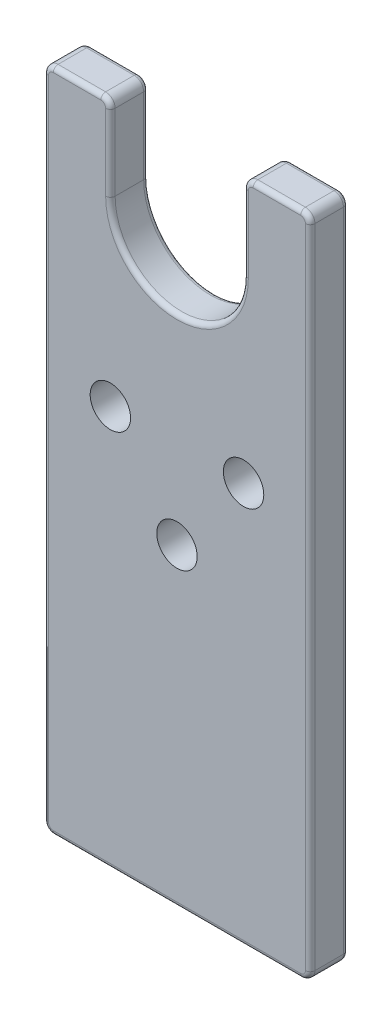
ISO-10303-21;
HEADER;
FILE_DESCRIPTION(('STEP AP214'),'2;1');
FILE_NAME('part.step','',(''),(''),'','','');
FILE_SCHEMA(('AUTOMOTIVE_DESIGN { 1 0 10303 214 1 1 1 1 }'));
ENDSEC;
DATA;
#1=APPLICATION_CONTEXT('core data for automotive mechanical design processes');
#2=APPLICATION_PROTOCOL_DEFINITION('international standard','automotive_design',2000,#1);
#3=PRODUCT_CONTEXT('',#1,'mechanical');
#4=PRODUCT('Part','Part','',(#3));
#5=PRODUCT_RELATED_PRODUCT_CATEGORY('part','',(#4));
#6=PRODUCT_DEFINITION_FORMATION('','',#4);
#7=PRODUCT_DEFINITION_CONTEXT('part definition',#1,'design');
#8=PRODUCT_DEFINITION('design','',#6,#7);
#9=PRODUCT_DEFINITION_SHAPE('','',#8);
#10=(LENGTH_UNIT() NAMED_UNIT(*) SI_UNIT(.MILLI.,.METRE.));
#11=(NAMED_UNIT(*) PLANE_ANGLE_UNIT() SI_UNIT($,.RADIAN.));
#12=(NAMED_UNIT(*) SI_UNIT($,.STERADIAN.) SOLID_ANGLE_UNIT());
#13=UNCERTAINTY_MEASURE_WITH_UNIT(LENGTH_MEASURE(1.E-05),#10,'distance_accuracy_value','');
#14=(GEOMETRIC_REPRESENTATION_CONTEXT(3) GLOBAL_UNCERTAINTY_ASSIGNED_CONTEXT((#13)) GLOBAL_UNIT_ASSIGNED_CONTEXT((#10,
#11,#12)) REPRESENTATION_CONTEXT('',''));
#15=CARTESIAN_POINT('',(0.,0.,0.));
#16=DIRECTION('',(0.,0.,1.));
#17=DIRECTION('',(1.,0.,0.));
#18=AXIS2_PLACEMENT_3D('',#15,#16,#17);
#19=CARTESIAN_POINT('',(44.45,193.675,12.7));
#20=DIRECTION('',(0.,0.,1.));
#21=DIRECTION('',(1.,0.,0.));
#22=AXIS2_PLACEMENT_3D('',#19,#20,#21);
#23=PLANE('',#22);
#24=DIRECTION('',(0.,-1.,0.));
#25=VECTOR('',#24,1.);
#26=CARTESIAN_POINT('',(87.3125,193.675,12.7));
#27=LINE('',#26,#25);
#28=CARTESIAN_POINT('',(87.3125,3.17500000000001,12.7));
#29=VERTEX_POINT('',#28);
#30=CARTESIAN_POINT('',(87.3125,219.075,12.7));
#31=VERTEX_POINT('',#30);
#32=EDGE_CURVE('E458',#29,#31,#27,.F.);
#33=ORIENTED_EDGE('',*,*,#32,.T.);
#34=CARTESIAN_POINT('',(85.725,219.075,12.7));
#35=DIRECTION('',(0.,0.,1.));
#36=DIRECTION('',(1.,0.,0.));
#37=AXIS2_PLACEMENT_3D('',#34,#35,#36);
#38=CIRCLE('',#37,1.5875);
#39=CARTESIAN_POINT('',(85.725,220.6625,12.7));
#40=VERTEX_POINT('',#39);
#41=EDGE_CURVE('E453',#31,#40,#38,.T.);
#42=ORIENTED_EDGE('',*,*,#41,.T.);
#43=DIRECTION('',(-1.,0.,0.));
#44=VECTOR('',#43,1.);
#45=CARTESIAN_POINT('',(69.85,220.6625,12.7));
#46=LINE('',#45,#44);
#47=CARTESIAN_POINT('',(69.85,220.6625,12.7));
#48=VERTEX_POINT('',#47);
#49=EDGE_CURVE('E456',#40,#48,#46,.T.);
#50=ORIENTED_EDGE('',*,*,#49,.T.);
#51=CARTESIAN_POINT('',(69.85,219.075,12.7));
#52=DIRECTION('',(0.,0.,1.));
#53=DIRECTION('',(1.,0.,0.));
#54=AXIS2_PLACEMENT_3D('',#51,#52,#53);
#55=CIRCLE('',#54,1.5875);
#56=CARTESIAN_POINT('',(68.2625,219.075,12.7));
#57=VERTEX_POINT('',#56);
#58=EDGE_CURVE('E460',#48,#57,#55,.T.);
#59=ORIENTED_EDGE('',*,*,#58,.T.);
#60=DIRECTION('',(0.,-1.,0.));
#61=VECTOR('',#60,1.);
#62=CARTESIAN_POINT('',(68.2625,193.675,12.7));
#63=LINE('',#62,#61);
#64=CARTESIAN_POINT('',(68.2625,193.675,12.7));
#65=VERTEX_POINT('',#64);
#66=EDGE_CURVE('E464',#57,#65,#63,.T.);
#67=ORIENTED_EDGE('',*,*,#66,.T.);
#68=CARTESIAN_POINT('',(44.45,193.675,12.7));
#69=DIRECTION('',(0.,0.,1.));
#70=DIRECTION('',(1.,0.,0.));
#71=AXIS2_PLACEMENT_3D('',#68,#69,#70);
#72=CIRCLE('',#71,23.8125);
#73=CARTESIAN_POINT('',(20.6375,193.675,12.7));
#74=VERTEX_POINT('',#73);
#75=EDGE_CURVE('E468',#65,#74,#72,.F.);
#76=ORIENTED_EDGE('',*,*,#75,.T.);
#77=DIRECTION('',(0.,-1.,0.));
#78=VECTOR('',#77,1.);
#79=CARTESIAN_POINT('',(20.6375,193.675,12.7));
#80=LINE('',#79,#78);
#81=CARTESIAN_POINT('',(20.6375,219.075,12.7));
#82=VERTEX_POINT('',#81);
#83=EDGE_CURVE('E226',#74,#82,#80,.F.);
#84=ORIENTED_EDGE('',*,*,#83,.T.);
#85=CARTESIAN_POINT('',(19.05,219.075,12.7));
#86=DIRECTION('',(0.,0.,1.));
#87=DIRECTION('',(1.,0.,0.));
#88=AXIS2_PLACEMENT_3D('',#85,#86,#87);
#89=CIRCLE('',#88,1.5875);
#90=CARTESIAN_POINT('',(19.05,220.6625,12.7));
#91=VERTEX_POINT('',#90);
#92=EDGE_CURVE('E220',#82,#91,#89,.T.);
#93=ORIENTED_EDGE('',*,*,#92,.T.);
#94=DIRECTION('',(-1.,0.,0.));
#95=VECTOR('',#94,1.);
#96=CARTESIAN_POINT('',(3.175,220.6625,12.7));
#97=LINE('',#96,#95);
#98=CARTESIAN_POINT('',(3.175,220.6625,12.7));
#99=VERTEX_POINT('',#98);
#100=EDGE_CURVE('E223',#91,#99,#97,.T.);
#101=ORIENTED_EDGE('',*,*,#100,.T.);
#102=CARTESIAN_POINT('',(3.175,219.075,12.7));
#103=DIRECTION('',(0.,0.,1.));
#104=DIRECTION('',(1.,0.,0.));
#105=AXIS2_PLACEMENT_3D('',#102,#103,#104);
#106=CIRCLE('',#105,1.5875);
#107=CARTESIAN_POINT('',(1.5875,219.075,12.7));
#108=VERTEX_POINT('',#107);
#109=EDGE_CURVE('E232',#99,#108,#106,.T.);
#110=ORIENTED_EDGE('',*,*,#109,.T.);
#111=DIRECTION('',(0.,1.,0.));
#112=VECTOR('',#111,1.);
#113=CARTESIAN_POINT('',(1.5875,193.675,12.7));
#114=LINE('',#113,#112);
#115=CARTESIAN_POINT('',(1.5875,3.175,12.7));
#116=VERTEX_POINT('',#115);
#117=EDGE_CURVE('E231',#108,#116,#114,.F.);
#118=ORIENTED_EDGE('',*,*,#117,.T.);
#119=CARTESIAN_POINT('',(3.175,3.175,12.7));
#120=DIRECTION('',(0.,0.,1.));
#121=DIRECTION('',(1.,0.,0.));
#122=AXIS2_PLACEMENT_3D('',#119,#120,#121);
#123=CIRCLE('',#122,1.5875);
#124=CARTESIAN_POINT('',(3.175,1.5875,12.7));
#125=VERTEX_POINT('',#124);
#126=EDGE_CURVE('E470',#116,#125,#123,.T.);
#127=ORIENTED_EDGE('',*,*,#126,.T.);
#128=DIRECTION('',(1.,0.,0.));
#129=VECTOR('',#128,1.);
#130=CARTESIAN_POINT('',(85.725,1.58749999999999,12.7));
#131=LINE('',#130,#129);
#132=CARTESIAN_POINT('',(85.725,1.58749999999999,12.7));
#133=VERTEX_POINT('',#132);
#134=EDGE_CURVE('E466',#125,#133,#131,.T.);
#135=ORIENTED_EDGE('',*,*,#134,.T.);
#136=CARTESIAN_POINT('',(85.725,3.17500000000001,12.7));
#137=DIRECTION('',(0.,0.,1.));
#138=DIRECTION('',(1.,0.,0.));
#139=AXIS2_PLACEMENT_3D('',#136,#137,#138);
#140=CIRCLE('',#139,1.5875);
#141=EDGE_CURVE('E462',#133,#29,#140,.T.);
#142=ORIENTED_EDGE('',*,*,#141,.T.);
#143=EDGE_LOOP('',(#33,#42,#50,#59,#67,#76,#84,#93,#101,#110,#118,#127,#135,#142));
#144=FACE_BOUND('',#143,.T.);
#145=CARTESIAN_POINT('',(44.4500000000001,104.775,12.7));
#146=DIRECTION('',(0.,0.,1.));
#147=DIRECTION('',(1.,0.,0.));
#148=AXIS2_PLACEMENT_3D('',#145,#146,#147);
#149=CIRCLE('',#148,6.7437);
#150=CARTESIAN_POINT('',(51.1937000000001,104.775,12.7));
#151=VERTEX_POINT('',#150);
#152=EDGE_CURVE('E508',#151,#151,#149,.T.);
#153=ORIENTED_EDGE('',*,*,#152,.F.);
#154=EDGE_LOOP('',(#153));
#155=FACE_BOUND('',#154,.T.);
#156=CARTESIAN_POINT('',(22.2250000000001,133.739183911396,12.7));
#157=DIRECTION('',(0.,0.,1.));
#158=DIRECTION('',(1.,0.,0.));
#159=AXIS2_PLACEMENT_3D('',#156,#157,#158);
#160=CIRCLE('',#159,6.7437);
#161=CARTESIAN_POINT('',(28.9687000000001,133.739183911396,12.7));
#162=VERTEX_POINT('',#161);
#163=EDGE_CURVE('E502',#162,#162,#160,.T.);
#164=ORIENTED_EDGE('',*,*,#163,.F.);
#165=EDGE_LOOP('',(#164));
#166=FACE_BOUND('',#165,.T.);
#167=CARTESIAN_POINT('',(66.6750000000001,133.739183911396,12.7));
#168=DIRECTION('',(0.,0.,1.));
#169=DIRECTION('',(1.,0.,0.));
#170=AXIS2_PLACEMENT_3D('',#167,#168,#169);
#171=CIRCLE('',#170,6.74370000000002);
#172=CARTESIAN_POINT('',(73.4187000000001,133.739183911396,12.7));
#173=VERTEX_POINT('',#172);
#174=EDGE_CURVE('E514',#173,#173,#171,.T.);
#175=ORIENTED_EDGE('',*,*,#174,.F.);
#176=EDGE_LOOP('',(#175));
#177=FACE_BOUND('',#176,.T.);
#178=ADVANCED_FACE('F34',(#144,#155,#166,#177),#23,.T.);
#179=CARTESIAN_POINT('',(44.45,193.675,0.));
#180=DIRECTION('',(0.,0.,1.));
#181=DIRECTION('',(1.,0.,0.));
#182=AXIS2_PLACEMENT_3D('',#179,#180,#181);
#183=PLANE('',#182);
#184=DIRECTION('',(-1.,0.,0.));
#185=VECTOR('',#184,1.);
#186=CARTESIAN_POINT('',(44.45,220.6625,0.));
#187=LINE('',#186,#185);
#188=CARTESIAN_POINT('',(69.85,220.6625,0.));
#189=VERTEX_POINT('',#188);
#190=CARTESIAN_POINT('',(85.725,220.6625,0.));
#191=VERTEX_POINT('',#190);
#192=EDGE_CURVE('E423',#189,#191,#187,.F.);
#193=ORIENTED_EDGE('',*,*,#192,.T.);
#194=CARTESIAN_POINT('',(85.725,219.075,0.));
#195=DIRECTION('',(0.,0.,1.));
#196=DIRECTION('',(1.,0.,0.));
#197=AXIS2_PLACEMENT_3D('',#194,#195,#196);
#198=CIRCLE('',#197,1.5875);
#199=CARTESIAN_POINT('',(87.3125,219.075,0.));
#200=VERTEX_POINT('',#199);
#201=EDGE_CURVE('E420',#191,#200,#198,.F.);
#202=ORIENTED_EDGE('',*,*,#201,.T.);
#203=DIRECTION('',(0.,-1.,0.));
#204=VECTOR('',#203,1.);
#205=CARTESIAN_POINT('',(87.3125,3.17500000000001,0.));
#206=LINE('',#205,#204);
#207=CARTESIAN_POINT('',(87.3125,3.17500000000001,0.));
#208=VERTEX_POINT('',#207);
#209=EDGE_CURVE('E425',#200,#208,#206,.T.);
#210=ORIENTED_EDGE('',*,*,#209,.T.);
#211=CARTESIAN_POINT('',(85.725,3.17500000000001,0.));
#212=DIRECTION('',(0.,0.,1.));
#213=DIRECTION('',(1.,0.,0.));
#214=AXIS2_PLACEMENT_3D('',#211,#212,#213);
#215=CIRCLE('',#214,1.5875);
#216=CARTESIAN_POINT('',(85.725,1.5875,0.));
#217=VERTEX_POINT('',#216);
#218=EDGE_CURVE('E429',#208,#217,#215,.F.);
#219=ORIENTED_EDGE('',*,*,#218,.T.);
#220=DIRECTION('',(1.,0.,0.));
#221=VECTOR('',#220,1.);
#222=CARTESIAN_POINT('',(44.45,1.58749999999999,0.));
#223=LINE('',#222,#221);
#224=CARTESIAN_POINT('',(3.175,1.5875,0.));
#225=VERTEX_POINT('',#224);
#226=EDGE_CURVE('E433',#217,#225,#223,.F.);
#227=ORIENTED_EDGE('',*,*,#226,.T.);
#228=CARTESIAN_POINT('',(3.175,3.175,0.));
#229=DIRECTION('',(0.,0.,1.));
#230=DIRECTION('',(1.,0.,0.));
#231=AXIS2_PLACEMENT_3D('',#228,#229,#230);
#232=CIRCLE('',#231,1.5875);
#233=CARTESIAN_POINT('',(1.5875,3.175,0.));
#234=VERTEX_POINT('',#233);
#235=EDGE_CURVE('E437',#225,#234,#232,.F.);
#236=ORIENTED_EDGE('',*,*,#235,.T.);
#237=DIRECTION('',(0.,1.,0.));
#238=VECTOR('',#237,1.);
#239=CARTESIAN_POINT('',(1.5875,219.075,0.));
#240=LINE('',#239,#238);
#241=CARTESIAN_POINT('',(1.5875,219.075,0.));
#242=VERTEX_POINT('',#241);
#243=EDGE_CURVE('E380',#234,#242,#240,.T.);
#244=ORIENTED_EDGE('',*,*,#243,.T.);
#245=CARTESIAN_POINT('',(3.175,219.075,0.));
#246=DIRECTION('',(0.,0.,1.));
#247=DIRECTION('',(1.,0.,0.));
#248=AXIS2_PLACEMENT_3D('',#245,#246,#247);
#249=CIRCLE('',#248,1.5875);
#250=CARTESIAN_POINT('',(3.175,220.6625,0.));
#251=VERTEX_POINT('',#250);
#252=EDGE_CURVE('E374',#242,#251,#249,.F.);
#253=ORIENTED_EDGE('',*,*,#252,.T.);
#254=DIRECTION('',(-1.,0.,0.));
#255=VECTOR('',#254,1.);
#256=CARTESIAN_POINT('',(44.45,220.6625,0.));
#257=LINE('',#256,#255);
#258=CARTESIAN_POINT('',(19.05,220.6625,0.));
#259=VERTEX_POINT('',#258);
#260=EDGE_CURVE('E445',#251,#259,#257,.F.);
#261=ORIENTED_EDGE('',*,*,#260,.T.);
#262=CARTESIAN_POINT('',(19.05,219.075,0.));
#263=DIRECTION('',(0.,0.,1.));
#264=DIRECTION('',(1.,0.,0.));
#265=AXIS2_PLACEMENT_3D('',#262,#263,#264);
#266=CIRCLE('',#265,1.5875);
#267=CARTESIAN_POINT('',(20.6375,219.075,0.));
#268=VERTEX_POINT('',#267);
#269=EDGE_CURVE('E442',#259,#268,#266,.F.);
#270=ORIENTED_EDGE('',*,*,#269,.T.);
#271=DIRECTION('',(0.,-1.,0.));
#272=VECTOR('',#271,1.);
#273=CARTESIAN_POINT('',(20.6375,193.675,0.));
#274=LINE('',#273,#272);
#275=CARTESIAN_POINT('',(20.6375,193.675,0.));
#276=VERTEX_POINT('',#275);
#277=EDGE_CURVE('E439',#268,#276,#274,.T.);
#278=ORIENTED_EDGE('',*,*,#277,.T.);
#279=CARTESIAN_POINT('',(44.45,193.675,0.));
#280=DIRECTION('',(0.,0.,1.));
#281=DIRECTION('',(1.,0.,0.));
#282=AXIS2_PLACEMENT_3D('',#279,#280,#281);
#283=CIRCLE('',#282,23.8125);
#284=CARTESIAN_POINT('',(68.2625,193.675,0.));
#285=VERTEX_POINT('',#284);
#286=EDGE_CURVE('E435',#276,#285,#283,.T.);
#287=ORIENTED_EDGE('',*,*,#286,.T.);
#288=DIRECTION('',(0.,-1.,0.));
#289=VECTOR('',#288,1.);
#290=CARTESIAN_POINT('',(68.2625,193.675,0.));
#291=LINE('',#290,#289);
#292=CARTESIAN_POINT('',(68.2625,219.075,0.));
#293=VERTEX_POINT('',#292);
#294=EDGE_CURVE('E431',#285,#293,#291,.F.);
#295=ORIENTED_EDGE('',*,*,#294,.T.);
#296=CARTESIAN_POINT('',(69.85,219.075,0.));
#297=DIRECTION('',(0.,0.,1.));
#298=DIRECTION('',(1.,0.,0.));
#299=AXIS2_PLACEMENT_3D('',#296,#297,#298);
#300=CIRCLE('',#299,1.5875);
#301=EDGE_CURVE('E427',#293,#189,#300,.F.);
#302=ORIENTED_EDGE('',*,*,#301,.T.);
#303=EDGE_LOOP('',(#193,#202,#210,#219,#227,#236,#244,#253,#261,#270,#278,#287,#295,#302));
#304=FACE_BOUND('',#303,.T.);
#305=CARTESIAN_POINT('',(44.4500000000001,104.775,0.));
#306=DIRECTION('',(0.,0.,1.));
#307=DIRECTION('',(1.,0.,0.));
#308=AXIS2_PLACEMENT_3D('',#305,#306,#307);
#309=CIRCLE('',#308,6.7437);
#310=CARTESIAN_POINT('',(51.1937000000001,104.775,0.));
#311=VERTEX_POINT('',#310);
#312=EDGE_CURVE('E511',#311,#311,#309,.T.);
#313=ORIENTED_EDGE('',*,*,#312,.T.);
#314=EDGE_LOOP('',(#313));
#315=FACE_BOUND('',#314,.T.);
#316=CARTESIAN_POINT('',(22.2250000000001,133.739183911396,0.));
#317=DIRECTION('',(0.,0.,1.));
#318=DIRECTION('',(1.,0.,0.));
#319=AXIS2_PLACEMENT_3D('',#316,#317,#318);
#320=CIRCLE('',#319,6.7437);
#321=CARTESIAN_POINT('',(28.9687000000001,133.739183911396,0.));
#322=VERTEX_POINT('',#321);
#323=EDGE_CURVE('E505',#322,#322,#320,.T.);
#324=ORIENTED_EDGE('',*,*,#323,.T.);
#325=EDGE_LOOP('',(#324));
#326=FACE_BOUND('',#325,.T.);
#327=CARTESIAN_POINT('',(66.6750000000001,133.739183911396,0.));
#328=DIRECTION('',(0.,0.,1.));
#329=DIRECTION('',(1.,0.,0.));
#330=AXIS2_PLACEMENT_3D('',#327,#328,#329);
#331=CIRCLE('',#330,6.74370000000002);
#332=CARTESIAN_POINT('',(73.4187000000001,133.739183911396,0.));
#333=VERTEX_POINT('',#332);
#334=EDGE_CURVE('E249',#333,#333,#331,.T.);
#335=ORIENTED_EDGE('',*,*,#334,.T.);
#336=EDGE_LOOP('',(#335));
#337=FACE_BOUND('',#336,.T.);
#338=ADVANCED_FACE('F526',(#304,#315,#326,#337),#183,.F.);
#339=CARTESIAN_POINT('',(0.,0.,12.7));
#340=DIRECTION('',(-1.,0.,0.));
#341=DIRECTION('',(0.,-1.,0.));
#342=AXIS2_PLACEMENT_3D('',#339,#340,#341);
#343=PLANE('',#342);
#344=DIRECTION('',(0.,0.,-1.));
#345=VECTOR('',#344,1.);
#346=CARTESIAN_POINT('',(0.,3.175,12.7));
#347=LINE('',#346,#345);
#348=CARTESIAN_POINT('',(0.,3.175,1.5875));
#349=VERTEX_POINT('',#348);
#350=CARTESIAN_POINT('',(0.,3.175,11.1125));
#351=VERTEX_POINT('',#350);
#352=EDGE_CURVE('E371',#349,#351,#347,.F.);
#353=ORIENTED_EDGE('',*,*,#352,.T.);
#354=DIRECTION('',(0.,1.,0.));
#355=VECTOR('',#354,1.);
#356=CARTESIAN_POINT('',(0.,0.,11.1125));
#357=LINE('',#356,#355);
#358=CARTESIAN_POINT('',(0.,219.075,11.1125));
#359=VERTEX_POINT('',#358);
#360=EDGE_CURVE('E347',#351,#359,#357,.T.);
#361=ORIENTED_EDGE('',*,*,#360,.T.);
#362=DIRECTION('',(0.,0.,-1.));
#363=VECTOR('',#362,1.);
#364=CARTESIAN_POINT('',(0.,219.075,0.));
#365=LINE('',#364,#363);
#366=CARTESIAN_POINT('',(0.,219.075,1.5875));
#367=VERTEX_POINT('',#366);
#368=EDGE_CURVE('E361',#359,#367,#365,.T.);
#369=ORIENTED_EDGE('',*,*,#368,.T.);
#370=DIRECTION('',(0.,1.,0.));
#371=VECTOR('',#370,1.);
#372=CARTESIAN_POINT('',(0.,3.17500000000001,1.5875));
#373=LINE('',#372,#371);
#374=EDGE_CURVE('E344',#367,#349,#373,.F.);
#375=ORIENTED_EDGE('',*,*,#374,.T.);
#376=EDGE_LOOP('',(#353,#361,#369,#375));
#377=FACE_BOUND('',#376,.T.);
#378=ADVANCED_FACE('F366',(#377),#343,.T.);
#379=CARTESIAN_POINT('',(0.,0.,12.7));
#380=DIRECTION('',(0.,1.,0.));
#381=DIRECTION('',(0.,0.,1.));
#382=AXIS2_PLACEMENT_3D('',#379,#380,#381);
#383=PLANE('',#382);
#384=DIRECTION('',(0.,0.,-1.));
#385=VECTOR('',#384,1.);
#386=CARTESIAN_POINT('',(85.725,0.,12.7));
#387=LINE('',#386,#385);
#388=CARTESIAN_POINT('',(85.725,0.,1.5875));
#389=VERTEX_POINT('',#388);
#390=CARTESIAN_POINT('',(85.725,0.,11.1125));
#391=VERTEX_POINT('',#390);
#392=EDGE_CURVE('E243',#389,#391,#387,.F.);
#393=ORIENTED_EDGE('',*,*,#392,.T.);
#394=DIRECTION('',(1.,0.,0.));
#395=VECTOR('',#394,1.);
#396=CARTESIAN_POINT('',(3.175,0.,11.1125));
#397=LINE('',#396,#395);
#398=CARTESIAN_POINT('',(3.175,0.,11.1125));
#399=VERTEX_POINT('',#398);
#400=EDGE_CURVE('E396',#391,#399,#397,.F.);
#401=ORIENTED_EDGE('',*,*,#400,.T.);
#402=DIRECTION('',(0.,0.,-1.));
#403=VECTOR('',#402,1.);
#404=CARTESIAN_POINT('',(3.175,0.,0.));
#405=LINE('',#404,#403);
#406=CARTESIAN_POINT('',(3.175,0.,1.5875));
#407=VERTEX_POINT('',#406);
#408=EDGE_CURVE('E477',#399,#407,#405,.T.);
#409=ORIENTED_EDGE('',*,*,#408,.T.);
#410=DIRECTION('',(1.,0.,0.));
#411=VECTOR('',#410,1.);
#412=CARTESIAN_POINT('',(0.,0.,1.5875));
#413=LINE('',#412,#411);
#414=EDGE_CURVE('E398',#407,#389,#413,.T.);
#415=ORIENTED_EDGE('',*,*,#414,.T.);
#416=EDGE_LOOP('',(#393,#401,#409,#415));
#417=FACE_BOUND('',#416,.T.);
#418=ADVANCED_FACE('F537',(#417),#383,.F.);
#419=CARTESIAN_POINT('',(88.9,222.25,12.7));
#420=DIRECTION('',(1.,0.,0.));
#421=DIRECTION('',(0.,1.,0.));
#422=AXIS2_PLACEMENT_3D('',#419,#420,#421);
#423=PLANE('',#422);
#424=DIRECTION('',(0.,0.,-1.));
#425=VECTOR('',#424,1.);
#426=CARTESIAN_POINT('',(88.9,219.075,12.7));
#427=LINE('',#426,#425);
#428=CARTESIAN_POINT('',(88.9,219.075,1.5875));
#429=VERTEX_POINT('',#428);
#430=CARTESIAN_POINT('',(88.9,219.075,11.1125));
#431=VERTEX_POINT('',#430);
#432=EDGE_CURVE('E479',#429,#431,#427,.F.);
#433=ORIENTED_EDGE('',*,*,#432,.T.);
#434=DIRECTION('',(0.,-1.,0.));
#435=VECTOR('',#434,1.);
#436=CARTESIAN_POINT('',(88.9,222.25,11.1125));
#437=LINE('',#436,#435);
#438=CARTESIAN_POINT('',(88.9,3.17500000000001,11.1125));
#439=VERTEX_POINT('',#438);
#440=EDGE_CURVE('E412',#431,#439,#437,.T.);
#441=ORIENTED_EDGE('',*,*,#440,.T.);
#442=DIRECTION('',(0.,0.,-1.));
#443=VECTOR('',#442,1.);
#444=CARTESIAN_POINT('',(88.9,3.17500000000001,0.));
#445=LINE('',#444,#443);
#446=CARTESIAN_POINT('',(88.9,3.17500000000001,1.5875));
#447=VERTEX_POINT('',#446);
#448=EDGE_CURVE('E370',#439,#447,#445,.T.);
#449=ORIENTED_EDGE('',*,*,#448,.T.);
#450=DIRECTION('',(0.,-1.,0.));
#451=VECTOR('',#450,1.);
#452=CARTESIAN_POINT('',(88.9,219.075,1.5875));
#453=LINE('',#452,#451);
#454=EDGE_CURVE('E414',#447,#429,#453,.F.);
#455=ORIENTED_EDGE('',*,*,#454,.T.);
#456=EDGE_LOOP('',(#433,#441,#449,#455));
#457=FACE_BOUND('',#456,.T.);
#458=ADVANCED_FACE('F540',(#457),#423,.T.);
#459=CARTESIAN_POINT('',(88.9,222.25,12.7));
#460=DIRECTION('',(0.,-1.,0.));
#461=DIRECTION('',(0.,0.,-1.));
#462=AXIS2_PLACEMENT_3D('',#459,#460,#461);
#463=PLANE('',#462);
#464=DIRECTION('',(0.,0.,-1.));
#465=VECTOR('',#464,1.);
#466=CARTESIAN_POINT('',(69.85,222.25,12.7));
#467=LINE('',#466,#465);
#468=CARTESIAN_POINT('',(69.85,222.25,1.5875));
#469=VERTEX_POINT('',#468);
#470=CARTESIAN_POINT('',(69.85,222.25,11.1125));
#471=VERTEX_POINT('',#470);
#472=EDGE_CURVE('E485',#469,#471,#467,.F.);
#473=ORIENTED_EDGE('',*,*,#472,.T.);
#474=DIRECTION('',(-1.,0.,0.));
#475=VECTOR('',#474,1.);
#476=CARTESIAN_POINT('',(85.725,222.25,11.1125));
#477=LINE('',#476,#475);
#478=CARTESIAN_POINT('',(85.725,222.25,11.1125));
#479=VERTEX_POINT('',#478);
#480=EDGE_CURVE('E416',#471,#479,#477,.F.);
#481=ORIENTED_EDGE('',*,*,#480,.T.);
#482=DIRECTION('',(0.,0.,-1.));
#483=VECTOR('',#482,1.);
#484=CARTESIAN_POINT('',(85.725,222.25,0.));
#485=LINE('',#484,#483);
#486=CARTESIAN_POINT('',(85.725,222.25,1.5875));
#487=VERTEX_POINT('',#486);
#488=EDGE_CURVE('E488',#479,#487,#485,.T.);
#489=ORIENTED_EDGE('',*,*,#488,.T.);
#490=DIRECTION('',(-1.,0.,0.));
#491=VECTOR('',#490,1.);
#492=CARTESIAN_POINT('',(88.9,222.25,1.5875));
#493=LINE('',#492,#491);
#494=EDGE_CURVE('E418',#487,#469,#493,.T.);
#495=ORIENTED_EDGE('',*,*,#494,.T.);
#496=EDGE_LOOP('',(#473,#481,#489,#495));
#497=FACE_BOUND('',#496,.T.);
#498=ADVANCED_FACE('F544',(#497),#463,.F.);
#499=CARTESIAN_POINT('',(66.675,222.25,12.7));
#500=DIRECTION('',(1.,0.,0.));
#501=DIRECTION('',(0.,0.,-1.));
#502=AXIS2_PLACEMENT_3D('',#499,#500,#501);
#503=PLANE('',#502);
#504=DIRECTION('',(0.,0.,-1.));
#505=VECTOR('',#504,1.);
#506=CARTESIAN_POINT('',(66.675,193.675,12.7));
#507=LINE('',#506,#505);
#508=CARTESIAN_POINT('',(66.675,193.675,11.1125));
#509=VERTEX_POINT('',#508);
#510=CARTESIAN_POINT('',(66.675,193.675,1.5875));
#511=VERTEX_POINT('',#510);
#512=EDGE_CURVE('E499',#509,#511,#507,.T.);
#513=ORIENTED_EDGE('',*,*,#512,.F.);
#514=DIRECTION('',(0.,-1.,0.));
#515=VECTOR('',#514,1.);
#516=CARTESIAN_POINT('',(66.675,219.075,11.1125));
#517=LINE('',#516,#515);
#518=CARTESIAN_POINT('',(66.675,219.075,11.1125));
#519=VERTEX_POINT('',#518);
#520=EDGE_CURVE('E400',#509,#519,#517,.F.);
#521=ORIENTED_EDGE('',*,*,#520,.T.);
#522=DIRECTION('',(0.,0.,-1.));
#523=VECTOR('',#522,1.);
#524=CARTESIAN_POINT('',(66.675,219.075,12.7));
#525=LINE('',#524,#523);
#526=CARTESIAN_POINT('',(66.675,219.075,1.5875));
#527=VERTEX_POINT('',#526);
#528=EDGE_CURVE('E491',#519,#527,#525,.T.);
#529=ORIENTED_EDGE('',*,*,#528,.T.);
#530=DIRECTION('',(0.,-1.,0.));
#531=VECTOR('',#530,1.);
#532=CARTESIAN_POINT('',(66.675,222.25,1.5875));
#533=LINE('',#532,#531);
#534=EDGE_CURVE('E402',#527,#511,#533,.T.);
#535=ORIENTED_EDGE('',*,*,#534,.T.);
#536=EDGE_LOOP('',(#513,#521,#529,#535));
#537=FACE_BOUND('',#536,.T.);
#538=ADVANCED_FACE('F548',(#537),#503,.F.);
#539=CARTESIAN_POINT('',(44.45,193.675,12.7));
#540=DIRECTION('',(0.,0.,-1.));
#541=DIRECTION('',(-1.,0.,0.));
#542=AXIS2_PLACEMENT_3D('',#539,#540,#541);
#543=CYLINDRICAL_SURFACE('',#542,22.225);
#544=DIRECTION('',(0.,0.,-1.));
#545=VECTOR('',#544,1.);
#546=CARTESIAN_POINT('',(22.225,193.675,12.7));
#547=LINE('',#546,#545);
#548=CARTESIAN_POINT('',(22.225,193.675,11.1125));
#549=VERTEX_POINT('',#548);
#550=CARTESIAN_POINT('',(22.225,193.675,1.5875));
#551=VERTEX_POINT('',#550);
#552=EDGE_CURVE('E500',#549,#551,#547,.T.);
#553=ORIENTED_EDGE('',*,*,#552,.F.);
#554=CARTESIAN_POINT('',(44.45,193.675,11.1125));
#555=DIRECTION('',(0.,0.,1.));
#556=DIRECTION('',(1.,0.,0.));
#557=AXIS2_PLACEMENT_3D('',#554,#555,#556);
#558=CIRCLE('',#557,22.225);
#559=EDGE_CURVE('E390',#549,#509,#558,.T.);
#560=ORIENTED_EDGE('',*,*,#559,.T.);
#561=ORIENTED_EDGE('',*,*,#512,.T.);
#562=CARTESIAN_POINT('',(44.45,193.675,1.5875));
#563=DIRECTION('',(0.,0.,1.));
#564=DIRECTION('',(1.,0.,0.));
#565=AXIS2_PLACEMENT_3D('',#562,#563,#564);
#566=CIRCLE('',#565,22.225);
#567=EDGE_CURVE('E392',#511,#551,#566,.F.);
#568=ORIENTED_EDGE('',*,*,#567,.T.);
#569=EDGE_LOOP('',(#553,#560,#561,#568));
#570=FACE_BOUND('',#569,.T.);
#571=ADVANCED_FACE('F552',(#570),#543,.F.);
#572=CARTESIAN_POINT('',(22.225,222.25,12.7));
#573=DIRECTION('',(1.,0.,0.));
#574=DIRECTION('',(0.,1.,0.));
#575=AXIS2_PLACEMENT_3D('',#572,#573,#574);
#576=PLANE('',#575);
#577=DIRECTION('',(0.,0.,-1.));
#578=VECTOR('',#577,1.);
#579=CARTESIAN_POINT('',(22.225,219.075,12.7));
#580=LINE('',#579,#578);
#581=CARTESIAN_POINT('',(22.225,219.075,1.5875));
#582=VERTEX_POINT('',#581);
#583=CARTESIAN_POINT('',(22.225,219.075,11.1125));
#584=VERTEX_POINT('',#583);
#585=EDGE_CURVE('E494',#582,#584,#580,.F.);
#586=ORIENTED_EDGE('',*,*,#585,.T.);
#587=DIRECTION('',(0.,-1.,0.));
#588=VECTOR('',#587,1.);
#589=CARTESIAN_POINT('',(22.225,222.25,11.1125));
#590=LINE('',#589,#588);
#591=EDGE_CURVE('E338',#584,#549,#590,.T.);
#592=ORIENTED_EDGE('',*,*,#591,.T.);
#593=ORIENTED_EDGE('',*,*,#552,.T.);
#594=DIRECTION('',(0.,-1.,0.));
#595=VECTOR('',#594,1.);
#596=CARTESIAN_POINT('',(22.225,219.075,1.5875));
#597=LINE('',#596,#595);
#598=EDGE_CURVE('E345',#551,#582,#597,.F.);
#599=ORIENTED_EDGE('',*,*,#598,.T.);
#600=EDGE_LOOP('',(#586,#592,#593,#599));
#601=FACE_BOUND('',#600,.T.);
#602=ADVANCED_FACE('F556',(#601),#576,.T.);
#603=CARTESIAN_POINT('',(22.225,222.25,12.7));
#604=DIRECTION('',(0.,-1.,0.));
#605=DIRECTION('',(0.,0.,-1.));
#606=AXIS2_PLACEMENT_3D('',#603,#604,#605);
#607=PLANE('',#606);
#608=DIRECTION('',(0.,0.,-1.));
#609=VECTOR('',#608,1.);
#610=CARTESIAN_POINT('',(3.175,222.25,12.7));
#611=LINE('',#610,#609);
#612=CARTESIAN_POINT('',(3.175,222.25,1.5875));
#613=VERTEX_POINT('',#612);
#614=CARTESIAN_POINT('',(3.175,222.25,11.1125));
#615=VERTEX_POINT('',#614);
#616=EDGE_CURVE('E362',#613,#615,#611,.F.);
#617=ORIENTED_EDGE('',*,*,#616,.T.);
#618=DIRECTION('',(-1.,0.,0.));
#619=VECTOR('',#618,1.);
#620=CARTESIAN_POINT('',(19.05,222.25,11.1125));
#621=LINE('',#620,#619);
#622=CARTESIAN_POINT('',(19.05,222.25,11.1125));
#623=VERTEX_POINT('',#622);
#624=EDGE_CURVE('E11',#615,#623,#621,.F.);
#625=ORIENTED_EDGE('',*,*,#624,.T.);
#626=DIRECTION('',(0.,0.,-1.));
#627=VECTOR('',#626,1.);
#628=CARTESIAN_POINT('',(19.05,222.25,0.));
#629=LINE('',#628,#627);
#630=CARTESIAN_POINT('',(19.05,222.25,1.5875));
#631=VERTEX_POINT('',#630);
#632=EDGE_CURVE('E496',#623,#631,#629,.T.);
#633=ORIENTED_EDGE('',*,*,#632,.T.);
#634=DIRECTION('',(-1.,0.,0.));
#635=VECTOR('',#634,1.);
#636=CARTESIAN_POINT('',(22.225,222.25,1.5875));
#637=LINE('',#636,#635);
#638=EDGE_CURVE('E43',#631,#613,#637,.T.);
#639=ORIENTED_EDGE('',*,*,#638,.T.);
#640=EDGE_LOOP('',(#617,#625,#633,#639));
#641=FACE_BOUND('',#640,.T.);
#642=ADVANCED_FACE('F560',(#641),#607,.F.);
#643=CARTESIAN_POINT('',(22.2250000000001,133.739183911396,12.7));
#644=DIRECTION('',(0.,0.,-1.));
#645=DIRECTION('',(-1.,0.,0.));
#646=AXIS2_PLACEMENT_3D('',#643,#644,#645);
#647=CYLINDRICAL_SURFACE('',#646,6.7437);
#648=ORIENTED_EDGE('',*,*,#163,.T.);
#649=EDGE_LOOP('',(#648));
#650=FACE_BOUND('',#649,.T.);
#651=ORIENTED_EDGE('',*,*,#323,.F.);
#652=EDGE_LOOP('',(#651));
#653=FACE_BOUND('',#652,.T.);
#654=ADVANCED_FACE('F534',(#650,#653),#647,.F.);
#655=CARTESIAN_POINT('',(44.4500000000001,104.775,12.7));
#656=DIRECTION('',(0.,0.,-1.));
#657=DIRECTION('',(-1.,0.,0.));
#658=AXIS2_PLACEMENT_3D('',#655,#656,#657);
#659=CYLINDRICAL_SURFACE('',#658,6.7437);
#660=ORIENTED_EDGE('',*,*,#152,.T.);
#661=EDGE_LOOP('',(#660));
#662=FACE_BOUND('',#661,.T.);
#663=ORIENTED_EDGE('',*,*,#312,.F.);
#664=EDGE_LOOP('',(#663));
#665=FACE_BOUND('',#664,.T.);
#666=ADVANCED_FACE('F751',(#662,#665),#659,.F.);
#667=CARTESIAN_POINT('',(66.6750000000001,133.739183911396,12.7));
#668=DIRECTION('',(0.,0.,-1.));
#669=DIRECTION('',(-1.,0.,0.));
#670=AXIS2_PLACEMENT_3D('',#667,#668,#669);
#671=CYLINDRICAL_SURFACE('',#670,6.74370000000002);
#672=ORIENTED_EDGE('',*,*,#174,.T.);
#673=EDGE_LOOP('',(#672));
#674=FACE_BOUND('',#673,.T.);
#675=ORIENTED_EDGE('',*,*,#334,.F.);
#676=EDGE_LOOP('',(#675));
#677=FACE_BOUND('',#676,.T.);
#678=ADVANCED_FACE('F522',(#674,#677),#671,.F.);
#679=CARTESIAN_POINT('',(19.05,219.075,12.7));
#680=DIRECTION('',(0.,0.,1.));
#681=DIRECTION('',(1.,0.,0.));
#682=AXIS2_PLACEMENT_3D('',#679,#680,#681);
#683=CYLINDRICAL_SURFACE('',#682,3.175);
#684=ORIENTED_EDGE('',*,*,#632,.F.);
#685=CARTESIAN_POINT('',(19.05,219.075,11.1125));
#686=DIRECTION('',(0.,0.,1.));
#687=DIRECTION('',(1.,0.,0.));
#688=AXIS2_PLACEMENT_3D('',#685,#686,#687);
#689=CIRCLE('',#688,3.175);
#690=EDGE_CURVE('E246',#623,#584,#689,.F.);
#691=ORIENTED_EDGE('',*,*,#690,.T.);
#692=ORIENTED_EDGE('',*,*,#585,.F.);
#693=CARTESIAN_POINT('',(19.05,219.075,1.5875));
#694=DIRECTION('',(0.,0.,1.));
#695=DIRECTION('',(1.,0.,0.));
#696=AXIS2_PLACEMENT_3D('',#693,#694,#695);
#697=CIRCLE('',#696,3.175);
#698=EDGE_CURVE('E354',#582,#631,#697,.T.);
#699=ORIENTED_EDGE('',*,*,#698,.T.);
#700=EDGE_LOOP('',(#684,#691,#692,#699));
#701=FACE_BOUND('',#700,.T.);
#702=ADVANCED_FACE('F565',(#701),#683,.T.);
#703=CARTESIAN_POINT('',(69.85,219.075,12.7));
#704=DIRECTION('',(0.,0.,-1.));
#705=DIRECTION('',(-1.,0.,0.));
#706=AXIS2_PLACEMENT_3D('',#703,#704,#705);
#707=CYLINDRICAL_SURFACE('',#706,3.175);
#708=ORIENTED_EDGE('',*,*,#528,.F.);
#709=CARTESIAN_POINT('',(69.85,219.075,11.1125));
#710=DIRECTION('',(0.,0.,1.));
#711=DIRECTION('',(1.,0.,0.));
#712=AXIS2_PLACEMENT_3D('',#709,#710,#711);
#713=CIRCLE('',#712,3.175);
#714=EDGE_CURVE('E408',#519,#471,#713,.F.);
#715=ORIENTED_EDGE('',*,*,#714,.T.);
#716=ORIENTED_EDGE('',*,*,#472,.F.);
#717=CARTESIAN_POINT('',(69.85,219.075,1.5875));
#718=DIRECTION('',(0.,0.,1.));
#719=DIRECTION('',(1.,0.,0.));
#720=AXIS2_PLACEMENT_3D('',#717,#718,#719);
#721=CIRCLE('',#720,3.175);
#722=EDGE_CURVE('E410',#469,#527,#721,.T.);
#723=ORIENTED_EDGE('',*,*,#722,.T.);
#724=EDGE_LOOP('',(#708,#715,#716,#723));
#725=FACE_BOUND('',#724,.T.);
#726=ADVANCED_FACE('F568',(#725),#707,.T.);
#727=CARTESIAN_POINT('',(3.175,219.075,12.7));
#728=DIRECTION('',(0.,0.,1.));
#729=DIRECTION('',(1.,0.,0.));
#730=AXIS2_PLACEMENT_3D('',#727,#728,#729);
#731=CYLINDRICAL_SURFACE('',#730,3.175);
#732=ORIENTED_EDGE('',*,*,#368,.F.);
#733=CARTESIAN_POINT('',(3.175,219.075,11.1125));
#734=DIRECTION('',(0.,0.,1.));
#735=DIRECTION('',(1.,0.,0.));
#736=AXIS2_PLACEMENT_3D('',#733,#734,#735);
#737=CIRCLE('',#736,3.175);
#738=EDGE_CURVE('E51',#359,#615,#737,.F.);
#739=ORIENTED_EDGE('',*,*,#738,.T.);
#740=ORIENTED_EDGE('',*,*,#616,.F.);
#741=CARTESIAN_POINT('',(3.175,219.075,1.5875));
#742=DIRECTION('',(0.,0.,1.));
#743=DIRECTION('',(1.,0.,0.));
#744=AXIS2_PLACEMENT_3D('',#741,#742,#743);
#745=CIRCLE('',#744,3.175);
#746=EDGE_CURVE('E357',#613,#367,#745,.T.);
#747=ORIENTED_EDGE('',*,*,#746,.T.);
#748=EDGE_LOOP('',(#732,#739,#740,#747));
#749=FACE_BOUND('',#748,.T.);
#750=ADVANCED_FACE('F360',(#749),#731,.T.);
#751=CARTESIAN_POINT('',(85.725,219.075,12.7));
#752=DIRECTION('',(0.,0.,1.));
#753=DIRECTION('',(1.,0.,0.));
#754=AXIS2_PLACEMENT_3D('',#751,#752,#753);
#755=CYLINDRICAL_SURFACE('',#754,3.175);
#756=ORIENTED_EDGE('',*,*,#488,.F.);
#757=CARTESIAN_POINT('',(85.725,219.075,11.1125));
#758=DIRECTION('',(0.,0.,1.));
#759=DIRECTION('',(1.,0.,0.));
#760=AXIS2_PLACEMENT_3D('',#757,#758,#759);
#761=CIRCLE('',#760,3.175);
#762=EDGE_CURVE('E447',#479,#431,#761,.F.);
#763=ORIENTED_EDGE('',*,*,#762,.T.);
#764=ORIENTED_EDGE('',*,*,#432,.F.);
#765=CARTESIAN_POINT('',(85.725,219.075,1.5875));
#766=DIRECTION('',(0.,0.,1.));
#767=DIRECTION('',(1.,0.,0.));
#768=AXIS2_PLACEMENT_3D('',#765,#766,#767);
#769=CIRCLE('',#768,3.175);
#770=EDGE_CURVE('E450',#429,#487,#769,.T.);
#771=ORIENTED_EDGE('',*,*,#770,.T.);
#772=EDGE_LOOP('',(#756,#763,#764,#771));
#773=FACE_BOUND('',#772,.T.);
#774=ADVANCED_FACE('F575',(#773),#755,.T.);
#775=CARTESIAN_POINT('',(85.725,3.17500000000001,12.7));
#776=DIRECTION('',(0.,0.,1.));
#777=DIRECTION('',(1.,0.,0.));
#778=AXIS2_PLACEMENT_3D('',#775,#776,#777);
#779=CYLINDRICAL_SURFACE('',#778,3.175);
#780=ORIENTED_EDGE('',*,*,#448,.F.);
#781=CARTESIAN_POINT('',(85.725,3.17500000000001,11.1125));
#782=DIRECTION('',(0.,0.,1.));
#783=DIRECTION('',(1.,0.,0.));
#784=AXIS2_PLACEMENT_3D('',#781,#782,#783);
#785=CIRCLE('',#784,3.175);
#786=EDGE_CURVE('E404',#439,#391,#785,.F.);
#787=ORIENTED_EDGE('',*,*,#786,.T.);
#788=ORIENTED_EDGE('',*,*,#392,.F.);
#789=CARTESIAN_POINT('',(85.725,3.17500000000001,1.5875));
#790=DIRECTION('',(0.,0.,1.));
#791=DIRECTION('',(1.,0.,0.));
#792=AXIS2_PLACEMENT_3D('',#789,#790,#791);
#793=CIRCLE('',#792,3.175);
#794=EDGE_CURVE('E406',#389,#447,#793,.T.);
#795=ORIENTED_EDGE('',*,*,#794,.T.);
#796=EDGE_LOOP('',(#780,#787,#788,#795));
#797=FACE_BOUND('',#796,.T.);
#798=ADVANCED_FACE('F578',(#797),#779,.T.);
#799=CARTESIAN_POINT('',(3.175,3.175,12.7));
#800=DIRECTION('',(0.,0.,1.));
#801=DIRECTION('',(1.,0.,0.));
#802=AXIS2_PLACEMENT_3D('',#799,#800,#801);
#803=CYLINDRICAL_SURFACE('',#802,3.175);
#804=ORIENTED_EDGE('',*,*,#408,.F.);
#805=CARTESIAN_POINT('',(3.175,3.175,11.1125));
#806=DIRECTION('',(0.,0.,1.));
#807=DIRECTION('',(1.,0.,0.));
#808=AXIS2_PLACEMENT_3D('',#805,#806,#807);
#809=CIRCLE('',#808,3.175);
#810=EDGE_CURVE('E349',#399,#351,#809,.F.);
#811=ORIENTED_EDGE('',*,*,#810,.T.);
#812=ORIENTED_EDGE('',*,*,#352,.F.);
#813=CARTESIAN_POINT('',(3.175,3.175,1.5875));
#814=DIRECTION('',(0.,0.,1.));
#815=DIRECTION('',(1.,0.,0.));
#816=AXIS2_PLACEMENT_3D('',#813,#814,#815);
#817=CIRCLE('',#816,3.175);
#818=EDGE_CURVE('E384',#349,#407,#817,.T.);
#819=ORIENTED_EDGE('',*,*,#818,.T.);
#820=EDGE_LOOP('',(#804,#811,#812,#819));
#821=FACE_BOUND('',#820,.T.);
#822=ADVANCED_FACE('F582',(#821),#803,.T.);
#823=CARTESIAN_POINT('',(44.45,220.6625,11.1125));
#824=DIRECTION('',(1.,0.,0.));
#825=DIRECTION('',(0.,0.,-1.));
#826=AXIS2_PLACEMENT_3D('',#823,#824,#825);
#827=CYLINDRICAL_SURFACE('',#826,1.5875);
#828=CARTESIAN_POINT('',(19.05,220.6625,11.1125));
#829=DIRECTION('',(1.,0.,0.));
#830=DIRECTION('',(0.,0.,-1.));
#831=AXIS2_PLACEMENT_3D('',#828,#829,#830);
#832=CIRCLE('',#831,1.5875);
#833=EDGE_CURVE('E238',#623,#91,#832,.T.);
#834=ORIENTED_EDGE('',*,*,#833,.F.);
#835=ORIENTED_EDGE('',*,*,#624,.F.);
#836=CARTESIAN_POINT('',(3.175,220.6625,11.1125));
#837=DIRECTION('',(-1.,0.,0.));
#838=DIRECTION('',(0.,0.,1.));
#839=AXIS2_PLACEMENT_3D('',#836,#837,#838);
#840=CIRCLE('',#839,1.5875);
#841=EDGE_CURVE('E241',#99,#615,#840,.T.);
#842=ORIENTED_EDGE('',*,*,#841,.F.);
#843=ORIENTED_EDGE('',*,*,#100,.F.);
#844=EDGE_LOOP('',(#834,#835,#842,#843));
#845=FACE_BOUND('',#844,.T.);
#846=ADVANCED_FACE('F236',(#845),#827,.T.);
#847=CARTESIAN_POINT('',(3.175,219.075,11.1125));
#848=DIRECTION('',(0.,0.,1.));
#849=DIRECTION('',(1.,0.,0.));
#850=AXIS2_PLACEMENT_3D('',#847,#848,#849);
#851=DEGENERATE_TOROIDAL_SURFACE('',#850,1.5875,1.5875,.T.);
#852=ORIENTED_EDGE('',*,*,#841,.T.);
#853=ORIENTED_EDGE('',*,*,#738,.F.);
#854=CARTESIAN_POINT('',(1.5875,219.075,11.1125));
#855=DIRECTION('',(0.,-1.,0.));
#856=DIRECTION('',(0.,0.,-1.));
#857=AXIS2_PLACEMENT_3D('',#854,#855,#856);
#858=CIRCLE('',#857,1.5875);
#859=EDGE_CURVE('E247',#108,#359,#858,.T.);
#860=ORIENTED_EDGE('',*,*,#859,.F.);
#861=ORIENTED_EDGE('',*,*,#109,.F.);
#862=EDGE_LOOP('',(#852,#853,#860,#861));
#863=FACE_BOUND('',#862,.T.);
#864=ADVANCED_FACE('F629',(#863),#851,.T.);
#865=CARTESIAN_POINT('',(19.05,219.075,11.1125));
#866=DIRECTION('',(0.,0.,1.));
#867=DIRECTION('',(1.,0.,0.));
#868=AXIS2_PLACEMENT_3D('',#865,#866,#867);
#869=DEGENERATE_TOROIDAL_SURFACE('',#868,1.5875,1.5875,.T.);
#870=ORIENTED_EDGE('',*,*,#833,.T.);
#871=ORIENTED_EDGE('',*,*,#92,.F.);
#872=CARTESIAN_POINT('',(20.6375,219.075,11.1125));
#873=DIRECTION('',(0.,-1.,0.));
#874=DIRECTION('',(0.,0.,-1.));
#875=AXIS2_PLACEMENT_3D('',#872,#873,#874);
#876=CIRCLE('',#875,1.5875);
#877=EDGE_CURVE('E252',#584,#82,#876,.T.);
#878=ORIENTED_EDGE('',*,*,#877,.F.);
#879=ORIENTED_EDGE('',*,*,#690,.F.);
#880=EDGE_LOOP('',(#870,#871,#878,#879));
#881=FACE_BOUND('',#880,.T.);
#882=ADVANCED_FACE('F245',(#881),#869,.T.);
#883=CARTESIAN_POINT('',(1.5875,0.,11.1125));
#884=DIRECTION('',(0.,1.,0.));
#885=DIRECTION('',(-1.,0.,0.));
#886=AXIS2_PLACEMENT_3D('',#883,#884,#885);
#887=CYLINDRICAL_SURFACE('',#886,1.5875);
#888=ORIENTED_EDGE('',*,*,#859,.T.);
#889=ORIENTED_EDGE('',*,*,#360,.F.);
#890=CARTESIAN_POINT('',(1.5875,3.175,11.1125));
#891=DIRECTION('',(0.,-1.,0.));
#892=DIRECTION('',(0.,0.,-1.));
#893=AXIS2_PLACEMENT_3D('',#890,#891,#892);
#894=CIRCLE('',#893,1.5875);
#895=EDGE_CURVE('E332',#116,#351,#894,.T.);
#896=ORIENTED_EDGE('',*,*,#895,.F.);
#897=ORIENTED_EDGE('',*,*,#117,.F.);
#898=EDGE_LOOP('',(#888,#889,#896,#897));
#899=FACE_BOUND('',#898,.T.);
#900=ADVANCED_FACE('F623',(#899),#887,.T.);
#901=CARTESIAN_POINT('',(20.6375,222.25,11.1125));
#902=DIRECTION('',(0.,-1.,0.));
#903=DIRECTION('',(1.,0.,0.));
#904=AXIS2_PLACEMENT_3D('',#901,#902,#903);
#905=CYLINDRICAL_SURFACE('',#904,1.5875);
#906=ORIENTED_EDGE('',*,*,#877,.T.);
#907=ORIENTED_EDGE('',*,*,#83,.F.);
#908=CARTESIAN_POINT('',(20.6375,193.675,11.1125));
#909=DIRECTION('',(0.,-1.,0.));
#910=DIRECTION('',(0.,0.,-1.));
#911=AXIS2_PLACEMENT_3D('',#908,#909,#910);
#912=CIRCLE('',#911,1.5875);
#913=EDGE_CURVE('E329',#549,#74,#912,.T.);
#914=ORIENTED_EDGE('',*,*,#913,.F.);
#915=ORIENTED_EDGE('',*,*,#591,.F.);
#916=EDGE_LOOP('',(#906,#907,#914,#915));
#917=FACE_BOUND('',#916,.T.);
#918=ADVANCED_FACE('F336',(#917),#905,.T.);
#919=CARTESIAN_POINT('',(3.175,3.175,11.1125));
#920=DIRECTION('',(0.,0.,1.));
#921=DIRECTION('',(1.,0.,0.));
#922=AXIS2_PLACEMENT_3D('',#919,#920,#921);
#923=DEGENERATE_TOROIDAL_SURFACE('',#922,1.5875,1.5875,.T.);
#924=ORIENTED_EDGE('',*,*,#895,.T.);
#925=ORIENTED_EDGE('',*,*,#810,.F.);
#926=CARTESIAN_POINT('',(3.175,1.5875,11.1125));
#927=DIRECTION('',(1.,0.,0.));
#928=DIRECTION('',(0.,0.,-1.));
#929=AXIS2_PLACEMENT_3D('',#926,#927,#928);
#930=CIRCLE('',#929,1.5875);
#931=EDGE_CURVE('E326',#125,#399,#930,.T.);
#932=ORIENTED_EDGE('',*,*,#931,.F.);
#933=ORIENTED_EDGE('',*,*,#126,.F.);
#934=EDGE_LOOP('',(#924,#925,#932,#933));
#935=FACE_BOUND('',#934,.T.);
#936=ADVANCED_FACE('F616',(#935),#923,.T.);
#937=CARTESIAN_POINT('',(44.45,193.675,11.1125));
#938=DIRECTION('',(0.,0.,1.));
#939=DIRECTION('',(1.,0.,0.));
#940=AXIS2_PLACEMENT_3D('',#937,#938,#939);
#941=TOROIDAL_SURFACE('',#940,23.8125,1.5875);
#942=ORIENTED_EDGE('',*,*,#913,.T.);
#943=ORIENTED_EDGE('',*,*,#75,.F.);
#944=CARTESIAN_POINT('',(68.2625,193.675,11.1125));
#945=DIRECTION('',(0.,1.,0.));
#946=DIRECTION('',(0.,0.,1.));
#947=AXIS2_PLACEMENT_3D('',#944,#945,#946);
#948=CIRCLE('',#947,1.5875);
#949=EDGE_CURVE('E323',#509,#65,#948,.T.);
#950=ORIENTED_EDGE('',*,*,#949,.F.);
#951=ORIENTED_EDGE('',*,*,#559,.F.);
#952=EDGE_LOOP('',(#942,#943,#950,#951));
#953=FACE_BOUND('',#952,.T.);
#954=ADVANCED_FACE('F612',(#953),#941,.T.);
#955=CARTESIAN_POINT('',(44.45,1.58749999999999,11.1125));
#956=DIRECTION('',(-1.,0.,0.));
#957=DIRECTION('',(0.,0.,1.));
#958=AXIS2_PLACEMENT_3D('',#955,#956,#957);
#959=CYLINDRICAL_SURFACE('',#958,1.5875);
#960=ORIENTED_EDGE('',*,*,#931,.T.);
#961=ORIENTED_EDGE('',*,*,#400,.F.);
#962=CARTESIAN_POINT('',(85.725,1.58749999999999,11.1125));
#963=DIRECTION('',(1.,0.,0.));
#964=DIRECTION('',(0.,0.,-1.));
#965=AXIS2_PLACEMENT_3D('',#962,#963,#964);
#966=CIRCLE('',#965,1.5875);
#967=EDGE_CURVE('E320',#133,#391,#966,.T.);
#968=ORIENTED_EDGE('',*,*,#967,.F.);
#969=ORIENTED_EDGE('',*,*,#134,.F.);
#970=EDGE_LOOP('',(#960,#961,#968,#969));
#971=FACE_BOUND('',#970,.T.);
#972=ADVANCED_FACE('F608',(#971),#959,.T.);
#973=CARTESIAN_POINT('',(68.2625,193.675,11.1125));
#974=DIRECTION('',(0.,1.,0.));
#975=DIRECTION('',(0.,0.,1.));
#976=AXIS2_PLACEMENT_3D('',#973,#974,#975);
#977=CYLINDRICAL_SURFACE('',#976,1.5875);
#978=ORIENTED_EDGE('',*,*,#949,.T.);
#979=ORIENTED_EDGE('',*,*,#66,.F.);
#980=CARTESIAN_POINT('',(68.2625,219.075,11.1125));
#981=DIRECTION('',(0.,1.,0.));
#982=DIRECTION('',(0.,0.,1.));
#983=AXIS2_PLACEMENT_3D('',#980,#981,#982);
#984=CIRCLE('',#983,1.5875);
#985=EDGE_CURVE('E317',#519,#57,#984,.T.);
#986=ORIENTED_EDGE('',*,*,#985,.F.);
#987=ORIENTED_EDGE('',*,*,#520,.F.);
#988=EDGE_LOOP('',(#978,#979,#986,#987));
#989=FACE_BOUND('',#988,.T.);
#990=ADVANCED_FACE('F604',(#989),#977,.T.);
#991=CARTESIAN_POINT('',(85.725,3.17500000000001,11.1125));
#992=DIRECTION('',(0.,0.,1.));
#993=DIRECTION('',(1.,0.,0.));
#994=AXIS2_PLACEMENT_3D('',#991,#992,#993);
#995=DEGENERATE_TOROIDAL_SURFACE('',#994,1.5875,1.5875,.T.);
#996=ORIENTED_EDGE('',*,*,#967,.T.);
#997=ORIENTED_EDGE('',*,*,#786,.F.);
#998=CARTESIAN_POINT('',(87.3125,3.17500000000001,11.1125));
#999=DIRECTION('',(0.,1.,0.));
#1000=DIRECTION('',(0.,0.,1.));
#1001=AXIS2_PLACEMENT_3D('',#998,#999,#1000);
#1002=CIRCLE('',#1001,1.5875);
#1003=EDGE_CURVE('E314',#29,#439,#1002,.T.);
#1004=ORIENTED_EDGE('',*,*,#1003,.F.);
#1005=ORIENTED_EDGE('',*,*,#141,.F.);
#1006=EDGE_LOOP('',(#996,#997,#1004,#1005));
#1007=FACE_BOUND('',#1006,.T.);
#1008=ADVANCED_FACE('F600',(#1007),#995,.T.);
#1009=CARTESIAN_POINT('',(69.85,219.075,11.1125));
#1010=DIRECTION('',(0.,0.,1.));
#1011=DIRECTION('',(1.,0.,0.));
#1012=AXIS2_PLACEMENT_3D('',#1009,#1010,#1011);
#1013=DEGENERATE_TOROIDAL_SURFACE('',#1012,1.5875,1.5875,.T.);
#1014=ORIENTED_EDGE('',*,*,#985,.T.);
#1015=ORIENTED_EDGE('',*,*,#58,.F.);
#1016=CARTESIAN_POINT('',(69.85,220.6625,11.1125));
#1017=DIRECTION('',(1.,0.,0.));
#1018=DIRECTION('',(0.,0.,-1.));
#1019=AXIS2_PLACEMENT_3D('',#1016,#1017,#1018);
#1020=CIRCLE('',#1019,1.5875);
#1021=EDGE_CURVE('E308',#471,#48,#1020,.T.);
#1022=ORIENTED_EDGE('',*,*,#1021,.F.);
#1023=ORIENTED_EDGE('',*,*,#714,.F.);
#1024=EDGE_LOOP('',(#1014,#1015,#1022,#1023));
#1025=FACE_BOUND('',#1024,.T.);
#1026=ADVANCED_FACE('F596',(#1025),#1013,.T.);
#1027=CARTESIAN_POINT('',(87.3125,222.25,11.1125));
#1028=DIRECTION('',(0.,-1.,0.));
#1029=DIRECTION('',(1.,0.,0.));
#1030=AXIS2_PLACEMENT_3D('',#1027,#1028,#1029);
#1031=CYLINDRICAL_SURFACE('',#1030,1.5875);
#1032=ORIENTED_EDGE('',*,*,#1003,.T.);
#1033=ORIENTED_EDGE('',*,*,#440,.F.);
#1034=CARTESIAN_POINT('',(87.3125,219.075,11.1125));
#1035=DIRECTION('',(0.,1.,0.));
#1036=DIRECTION('',(0.,0.,1.));
#1037=AXIS2_PLACEMENT_3D('',#1034,#1035,#1036);
#1038=CIRCLE('',#1037,1.5875);
#1039=EDGE_CURVE('E301',#31,#431,#1038,.T.);
#1040=ORIENTED_EDGE('',*,*,#1039,.F.);
#1041=ORIENTED_EDGE('',*,*,#32,.F.);
#1042=EDGE_LOOP('',(#1032,#1033,#1040,#1041));
#1043=FACE_BOUND('',#1042,.T.);
#1044=ADVANCED_FACE('F592',(#1043),#1031,.T.);
#1045=CARTESIAN_POINT('',(44.45,220.6625,11.1125));
#1046=DIRECTION('',(1.,0.,0.));
#1047=DIRECTION('',(0.,0.,-1.));
#1048=AXIS2_PLACEMENT_3D('',#1045,#1046,#1047);
#1049=CYLINDRICAL_SURFACE('',#1048,1.5875);
#1050=ORIENTED_EDGE('',*,*,#1021,.T.);
#1051=ORIENTED_EDGE('',*,*,#49,.F.);
#1052=CARTESIAN_POINT('',(85.725,220.6625,11.1125));
#1053=DIRECTION('',(1.,0.,0.));
#1054=DIRECTION('',(0.,0.,-1.));
#1055=AXIS2_PLACEMENT_3D('',#1052,#1053,#1054);
#1056=CIRCLE('',#1055,1.5875);
#1057=EDGE_CURVE('E296',#479,#40,#1056,.T.);
#1058=ORIENTED_EDGE('',*,*,#1057,.F.);
#1059=ORIENTED_EDGE('',*,*,#480,.F.);
#1060=EDGE_LOOP('',(#1050,#1051,#1058,#1059));
#1061=FACE_BOUND('',#1060,.T.);
#1062=ADVANCED_FACE('F589',(#1061),#1049,.T.);
#1063=CARTESIAN_POINT('',(85.725,219.075,11.1125));
#1064=DIRECTION('',(0.,0.,1.));
#1065=DIRECTION('',(1.,0.,0.));
#1066=AXIS2_PLACEMENT_3D('',#1063,#1064,#1065);
#1067=DEGENERATE_TOROIDAL_SURFACE('',#1066,1.5875,1.5875,.T.);
#1068=ORIENTED_EDGE('',*,*,#1039,.T.);
#1069=ORIENTED_EDGE('',*,*,#762,.F.);
#1070=ORIENTED_EDGE('',*,*,#1057,.T.);
#1071=ORIENTED_EDGE('',*,*,#41,.F.);
#1072=EDGE_LOOP('',(#1068,#1069,#1070,#1071));
#1073=FACE_BOUND('',#1072,.T.);
#1074=ADVANCED_FACE('F586',(#1073),#1067,.T.);
#1075=CARTESIAN_POINT('',(22.225,220.6625,1.5875));
#1076=DIRECTION('',(-1.,0.,0.));
#1077=DIRECTION('',(0.,0.,1.));
#1078=AXIS2_PLACEMENT_3D('',#1075,#1076,#1077);
#1079=CYLINDRICAL_SURFACE('',#1078,1.5875);
#1080=CARTESIAN_POINT('',(3.175,220.6625,1.5875));
#1081=DIRECTION('',(-1.,0.,0.));
#1082=DIRECTION('',(0.,0.,1.));
#1083=AXIS2_PLACEMENT_3D('',#1080,#1081,#1082);
#1084=CIRCLE('',#1083,1.5875);
#1085=EDGE_CURVE('E289',#613,#251,#1084,.T.);
#1086=ORIENTED_EDGE('',*,*,#1085,.F.);
#1087=ORIENTED_EDGE('',*,*,#638,.F.);
#1088=CARTESIAN_POINT('',(19.05,220.6625,1.5875));
#1089=DIRECTION('',(1.,0.,0.));
#1090=DIRECTION('',(0.,0.,-1.));
#1091=AXIS2_PLACEMENT_3D('',#1088,#1089,#1090);
#1092=CIRCLE('',#1091,1.5875);
#1093=EDGE_CURVE('E38',#259,#631,#1092,.T.);
#1094=ORIENTED_EDGE('',*,*,#1093,.F.);
#1095=ORIENTED_EDGE('',*,*,#260,.F.);
#1096=EDGE_LOOP('',(#1086,#1087,#1094,#1095));
#1097=FACE_BOUND('',#1096,.T.);
#1098=ADVANCED_FACE('F36',(#1097),#1079,.T.);
#1099=CARTESIAN_POINT('',(19.05,219.075,1.5875));
#1100=DIRECTION('',(0.,0.,1.));
#1101=DIRECTION('',(1.,0.,0.));
#1102=AXIS2_PLACEMENT_3D('',#1099,#1100,#1101);
#1103=DEGENERATE_TOROIDAL_SURFACE('',#1102,1.5875,1.5875,.T.);
#1104=ORIENTED_EDGE('',*,*,#1093,.T.);
#1105=ORIENTED_EDGE('',*,*,#698,.F.);
#1106=CARTESIAN_POINT('',(20.6375,219.075,1.5875));
#1107=DIRECTION('',(0.,-1.,0.));
#1108=DIRECTION('',(0.,0.,-1.));
#1109=AXIS2_PLACEMENT_3D('',#1106,#1107,#1108);
#1110=CIRCLE('',#1109,1.5875);
#1111=EDGE_CURVE('E287',#268,#582,#1110,.T.);
#1112=ORIENTED_EDGE('',*,*,#1111,.F.);
#1113=ORIENTED_EDGE('',*,*,#269,.F.);
#1114=EDGE_LOOP('',(#1104,#1105,#1112,#1113));
#1115=FACE_BOUND('',#1114,.T.);
#1116=ADVANCED_FACE('F676',(#1115),#1103,.T.);
#1117=CARTESIAN_POINT('',(3.175,219.075,1.5875));
#1118=DIRECTION('',(0.,0.,1.));
#1119=DIRECTION('',(1.,0.,0.));
#1120=AXIS2_PLACEMENT_3D('',#1117,#1118,#1119);
#1121=DEGENERATE_TOROIDAL_SURFACE('',#1120,1.5875,1.5875,.T.);
#1122=ORIENTED_EDGE('',*,*,#1085,.T.);
#1123=ORIENTED_EDGE('',*,*,#252,.F.);
#1124=CARTESIAN_POINT('',(1.5875,219.075,1.5875));
#1125=DIRECTION('',(0.,-1.,0.));
#1126=DIRECTION('',(0.,0.,-1.));
#1127=AXIS2_PLACEMENT_3D('',#1124,#1125,#1126);
#1128=CIRCLE('',#1127,1.5875);
#1129=EDGE_CURVE('E284',#367,#242,#1128,.T.);
#1130=ORIENTED_EDGE('',*,*,#1129,.F.);
#1131=ORIENTED_EDGE('',*,*,#746,.F.);
#1132=EDGE_LOOP('',(#1122,#1123,#1130,#1131));
#1133=FACE_BOUND('',#1132,.T.);
#1134=ADVANCED_FACE('F373',(#1133),#1121,.T.);
#1135=CARTESIAN_POINT('',(20.6375,193.675,1.5875));
#1136=DIRECTION('',(0.,1.,0.));
#1137=DIRECTION('',(-1.,0.,0.));
#1138=AXIS2_PLACEMENT_3D('',#1135,#1136,#1137);
#1139=CYLINDRICAL_SURFACE('',#1138,1.5875);
#1140=ORIENTED_EDGE('',*,*,#1111,.T.);
#1141=ORIENTED_EDGE('',*,*,#598,.F.);
#1142=CARTESIAN_POINT('',(20.6375,193.675,1.5875));
#1143=DIRECTION('',(0.,-1.,0.));
#1144=DIRECTION('',(0.,0.,-1.));
#1145=AXIS2_PLACEMENT_3D('',#1142,#1143,#1144);
#1146=CIRCLE('',#1145,1.5875);
#1147=EDGE_CURVE('E281',#276,#551,#1146,.T.);
#1148=ORIENTED_EDGE('',*,*,#1147,.F.);
#1149=ORIENTED_EDGE('',*,*,#277,.F.);
#1150=EDGE_LOOP('',(#1140,#1141,#1148,#1149));
#1151=FACE_BOUND('',#1150,.T.);
#1152=ADVANCED_FACE('F671',(#1151),#1139,.T.);
#1153=CARTESIAN_POINT('',(1.5875,193.675,1.5875));
#1154=DIRECTION('',(0.,-1.,0.));
#1155=DIRECTION('',(1.,0.,0.));
#1156=AXIS2_PLACEMENT_3D('',#1153,#1154,#1155);
#1157=CYLINDRICAL_SURFACE('',#1156,1.5875);
#1158=ORIENTED_EDGE('',*,*,#1129,.T.);
#1159=ORIENTED_EDGE('',*,*,#243,.F.);
#1160=CARTESIAN_POINT('',(1.5875,3.175,1.5875));
#1161=DIRECTION('',(0.,-1.,0.));
#1162=DIRECTION('',(0.,0.,-1.));
#1163=AXIS2_PLACEMENT_3D('',#1160,#1161,#1162);
#1164=CIRCLE('',#1163,1.5875);
#1165=EDGE_CURVE('E278',#349,#234,#1164,.T.);
#1166=ORIENTED_EDGE('',*,*,#1165,.F.);
#1167=ORIENTED_EDGE('',*,*,#374,.F.);
#1168=EDGE_LOOP('',(#1158,#1159,#1166,#1167));
#1169=FACE_BOUND('',#1168,.T.);
#1170=ADVANCED_FACE('F378',(#1169),#1157,.T.);
#1171=CARTESIAN_POINT('',(44.45,193.675,1.5875));
#1172=DIRECTION('',(0.,0.,1.));
#1173=DIRECTION('',(1.,0.,0.));
#1174=AXIS2_PLACEMENT_3D('',#1171,#1172,#1173);
#1175=TOROIDAL_SURFACE('',#1174,23.8125,1.5875);
#1176=ORIENTED_EDGE('',*,*,#1147,.T.);
#1177=ORIENTED_EDGE('',*,*,#567,.F.);
#1178=CARTESIAN_POINT('',(68.2625,193.675,1.5875));
#1179=DIRECTION('',(0.,1.,0.));
#1180=DIRECTION('',(0.,0.,1.));
#1181=AXIS2_PLACEMENT_3D('',#1178,#1179,#1180);
#1182=CIRCLE('',#1181,1.5875);
#1183=EDGE_CURVE('E275',#285,#511,#1182,.T.);
#1184=ORIENTED_EDGE('',*,*,#1183,.F.);
#1185=ORIENTED_EDGE('',*,*,#286,.F.);
#1186=EDGE_LOOP('',(#1176,#1177,#1184,#1185));
#1187=FACE_BOUND('',#1186,.T.);
#1188=ADVANCED_FACE('F665',(#1187),#1175,.T.);
#1189=CARTESIAN_POINT('',(3.175,3.175,1.5875));
#1190=DIRECTION('',(0.,0.,1.));
#1191=DIRECTION('',(1.,0.,0.));
#1192=AXIS2_PLACEMENT_3D('',#1189,#1190,#1191);
#1193=DEGENERATE_TOROIDAL_SURFACE('',#1192,1.5875,1.5875,.T.);
#1194=ORIENTED_EDGE('',*,*,#1165,.T.);
#1195=ORIENTED_EDGE('',*,*,#235,.F.);
#1196=CARTESIAN_POINT('',(3.175,1.5875,1.5875));
#1197=DIRECTION('',(1.,0.,0.));
#1198=DIRECTION('',(0.,0.,-1.));
#1199=AXIS2_PLACEMENT_3D('',#1196,#1197,#1198);
#1200=CIRCLE('',#1199,1.5875);
#1201=EDGE_CURVE('E272',#407,#225,#1200,.T.);
#1202=ORIENTED_EDGE('',*,*,#1201,.F.);
#1203=ORIENTED_EDGE('',*,*,#818,.F.);
#1204=EDGE_LOOP('',(#1194,#1195,#1202,#1203));
#1205=FACE_BOUND('',#1204,.T.);
#1206=ADVANCED_FACE('F385',(#1205),#1193,.T.);
#1207=CARTESIAN_POINT('',(68.2625,222.25,1.5875));
#1208=DIRECTION('',(0.,-1.,0.));
#1209=DIRECTION('',(0.,0.,-1.));
#1210=AXIS2_PLACEMENT_3D('',#1207,#1208,#1209);
#1211=CYLINDRICAL_SURFACE('',#1210,1.5875);
#1212=ORIENTED_EDGE('',*,*,#1183,.T.);
#1213=ORIENTED_EDGE('',*,*,#534,.F.);
#1214=CARTESIAN_POINT('',(68.2625,219.075,1.5875));
#1215=DIRECTION('',(0.,1.,0.));
#1216=DIRECTION('',(0.,0.,1.));
#1217=AXIS2_PLACEMENT_3D('',#1214,#1215,#1216);
#1218=CIRCLE('',#1217,1.5875);
#1219=EDGE_CURVE('E269',#293,#527,#1218,.T.);
#1220=ORIENTED_EDGE('',*,*,#1219,.F.);
#1221=ORIENTED_EDGE('',*,*,#294,.F.);
#1222=EDGE_LOOP('',(#1212,#1213,#1220,#1221));
#1223=FACE_BOUND('',#1222,.T.);
#1224=ADVANCED_FACE('F658',(#1223),#1211,.T.);
#1225=CARTESIAN_POINT('',(0.,1.5875,1.5875));
#1226=DIRECTION('',(1.,0.,0.));
#1227=DIRECTION('',(0.,0.,-1.));
#1228=AXIS2_PLACEMENT_3D('',#1225,#1226,#1227);
#1229=CYLINDRICAL_SURFACE('',#1228,1.5875);
#1230=ORIENTED_EDGE('',*,*,#1201,.T.);
#1231=ORIENTED_EDGE('',*,*,#226,.F.);
#1232=CARTESIAN_POINT('',(85.725,1.5875,1.5875));
#1233=DIRECTION('',(1.,0.,0.));
#1234=DIRECTION('',(0.,0.,-1.));
#1235=AXIS2_PLACEMENT_3D('',#1232,#1233,#1234);
#1236=CIRCLE('',#1235,1.5875);
#1237=EDGE_CURVE('E266',#389,#217,#1236,.T.);
#1238=ORIENTED_EDGE('',*,*,#1237,.F.);
#1239=ORIENTED_EDGE('',*,*,#414,.F.);
#1240=EDGE_LOOP('',(#1230,#1231,#1238,#1239));
#1241=FACE_BOUND('',#1240,.T.);
#1242=ADVANCED_FACE('F654',(#1241),#1229,.T.);
#1243=CARTESIAN_POINT('',(69.85,219.075,1.5875));
#1244=DIRECTION('',(0.,0.,1.));
#1245=DIRECTION('',(1.,0.,0.));
#1246=AXIS2_PLACEMENT_3D('',#1243,#1244,#1245);
#1247=DEGENERATE_TOROIDAL_SURFACE('',#1246,1.5875,1.5875,.T.);
#1248=ORIENTED_EDGE('',*,*,#1219,.T.);
#1249=ORIENTED_EDGE('',*,*,#722,.F.);
#1250=CARTESIAN_POINT('',(69.85,220.6625,1.5875));
#1251=DIRECTION('',(1.,0.,0.));
#1252=DIRECTION('',(0.,0.,-1.));
#1253=AXIS2_PLACEMENT_3D('',#1250,#1251,#1252);
#1254=CIRCLE('',#1253,1.5875);
#1255=EDGE_CURVE('E263',#189,#469,#1254,.T.);
#1256=ORIENTED_EDGE('',*,*,#1255,.F.);
#1257=ORIENTED_EDGE('',*,*,#301,.F.);
#1258=EDGE_LOOP('',(#1248,#1249,#1256,#1257));
#1259=FACE_BOUND('',#1258,.T.);
#1260=ADVANCED_FACE('F650',(#1259),#1247,.T.);
#1261=CARTESIAN_POINT('',(85.725,3.17500000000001,1.5875));
#1262=DIRECTION('',(0.,0.,1.));
#1263=DIRECTION('',(1.,0.,0.));
#1264=AXIS2_PLACEMENT_3D('',#1261,#1262,#1263);
#1265=DEGENERATE_TOROIDAL_SURFACE('',#1264,1.5875,1.5875,.T.);
#1266=ORIENTED_EDGE('',*,*,#1237,.T.);
#1267=ORIENTED_EDGE('',*,*,#218,.F.);
#1268=CARTESIAN_POINT('',(87.3125,3.17500000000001,1.5875));
#1269=DIRECTION('',(0.,1.,0.));
#1270=DIRECTION('',(-1.,0.,0.));
#1271=AXIS2_PLACEMENT_3D('',#1268,#1269,#1270);
#1272=CIRCLE('',#1271,1.5875);
#1273=EDGE_CURVE('E260',#447,#208,#1272,.T.);
#1274=ORIENTED_EDGE('',*,*,#1273,.F.);
#1275=ORIENTED_EDGE('',*,*,#794,.F.);
#1276=EDGE_LOOP('',(#1266,#1267,#1274,#1275));
#1277=FACE_BOUND('',#1276,.T.);
#1278=ADVANCED_FACE('F646',(#1277),#1265,.T.);
#1279=CARTESIAN_POINT('',(88.9,220.6625,1.5875));
#1280=DIRECTION('',(-1.,0.,0.));
#1281=DIRECTION('',(0.,0.,1.));
#1282=AXIS2_PLACEMENT_3D('',#1279,#1280,#1281);
#1283=CYLINDRICAL_SURFACE('',#1282,1.5875);
#1284=ORIENTED_EDGE('',*,*,#1255,.T.);
#1285=ORIENTED_EDGE('',*,*,#494,.F.);
#1286=CARTESIAN_POINT('',(85.725,220.6625,1.5875));
#1287=DIRECTION('',(1.,0.,0.));
#1288=DIRECTION('',(0.,0.,-1.));
#1289=AXIS2_PLACEMENT_3D('',#1286,#1287,#1288);
#1290=CIRCLE('',#1289,1.5875);
#1291=EDGE_CURVE('E258',#191,#487,#1290,.T.);
#1292=ORIENTED_EDGE('',*,*,#1291,.F.);
#1293=ORIENTED_EDGE('',*,*,#192,.F.);
#1294=EDGE_LOOP('',(#1284,#1285,#1292,#1293));
#1295=FACE_BOUND('',#1294,.T.);
#1296=ADVANCED_FACE('F642',(#1295),#1283,.T.);
#1297=CARTESIAN_POINT('',(87.3125,193.675,1.5875));
#1298=DIRECTION('',(0.,1.,0.));
#1299=DIRECTION('',(-1.,0.,0.));
#1300=AXIS2_PLACEMENT_3D('',#1297,#1298,#1299);
#1301=CYLINDRICAL_SURFACE('',#1300,1.5875);
#1302=ORIENTED_EDGE('',*,*,#1273,.T.);
#1303=ORIENTED_EDGE('',*,*,#209,.F.);
#1304=CARTESIAN_POINT('',(87.3125,219.075,1.5875));
#1305=DIRECTION('',(0.,1.,0.));
#1306=DIRECTION('',(0.,0.,1.));
#1307=AXIS2_PLACEMENT_3D('',#1304,#1305,#1306);
#1308=CIRCLE('',#1307,1.5875);
#1309=EDGE_CURVE('E256',#429,#200,#1308,.T.);
#1310=ORIENTED_EDGE('',*,*,#1309,.F.);
#1311=ORIENTED_EDGE('',*,*,#454,.F.);
#1312=EDGE_LOOP('',(#1302,#1303,#1310,#1311));
#1313=FACE_BOUND('',#1312,.T.);
#1314=ADVANCED_FACE('F638',(#1313),#1301,.T.);
#1315=CARTESIAN_POINT('',(85.725,219.075,1.5875));
#1316=DIRECTION('',(0.,0.,1.));
#1317=DIRECTION('',(1.,0.,0.));
#1318=AXIS2_PLACEMENT_3D('',#1315,#1316,#1317);
#1319=DEGENERATE_TOROIDAL_SURFACE('',#1318,1.5875,1.5875,.T.);
#1320=ORIENTED_EDGE('',*,*,#1291,.T.);
#1321=ORIENTED_EDGE('',*,*,#770,.F.);
#1322=ORIENTED_EDGE('',*,*,#1309,.T.);
#1323=ORIENTED_EDGE('',*,*,#201,.F.);
#1324=EDGE_LOOP('',(#1320,#1321,#1322,#1323));
#1325=FACE_BOUND('',#1324,.T.);
#1326=ADVANCED_FACE('F635',(#1325),#1319,.T.);
#1327=CLOSED_SHELL('',(#178,#338,#378,#418,#458,#498,#538,#571,#602,#642,#654,#666,#678,#702,
#726,#750,#774,#798,#822,#846,#864,#882,#900,#918,#936,#954,#972,#990,#1008,#1026,#1044,#1062,
#1074,#1098,#1116,#1134,#1152,#1170,#1188,#1206,#1224,#1242,#1260,#1278,#1296,#1314,#1326));
#1328=MANIFOLD_SOLID_BREP('B2',#1327);
#1329=ADVANCED_BREP_SHAPE_REPRESENTATION('',(#18,#1328),#14);
#1330=SHAPE_DEFINITION_REPRESENTATION(#9,#1329);
ENDSEC;
END-ISO-10303-21;
